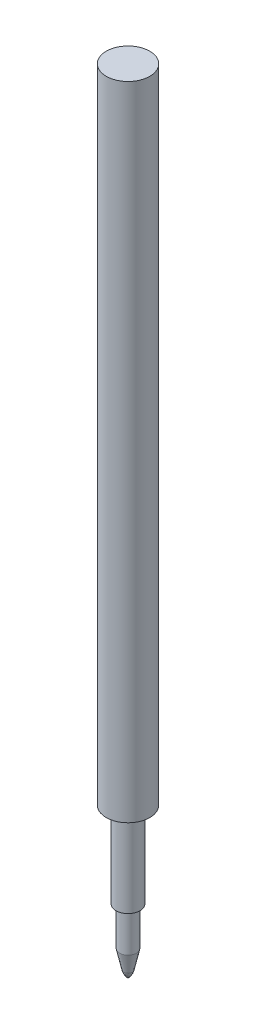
from build123d import *


with BuildPart() as part:
    # Sketch1 → Revolve1 (revolve)
    with BuildSketch(Plane.XY, mode=Mode.PRIVATE) as revolve1_sk:
        with BuildLine():
            Line((0, 0), (0, 111))
            Line((0, 111), (3.05, 111))
            Line((3.05, 111), (3.05, 21))
            Line((3.05, 21), (1.675, 21))
            Line((1.675, 21), (1.675, 9))
            Line((1.675, 9), (1.175, 9))
            Line((1.175, 9), (1.175, 3.6))
            Line((1.175, 3.6), (0.6, 1))
            ThreePointArc((0.6, 1), (0.381400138, 0.451159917), (0, 0))
        make_face()
    revolve(revolve1_sk.sketch.rotate(Axis((0, 0, 0), (0, 1, 0)), 90), axis=Axis((0, 0, 0), (0, 1, 0)))


solid = part.part
